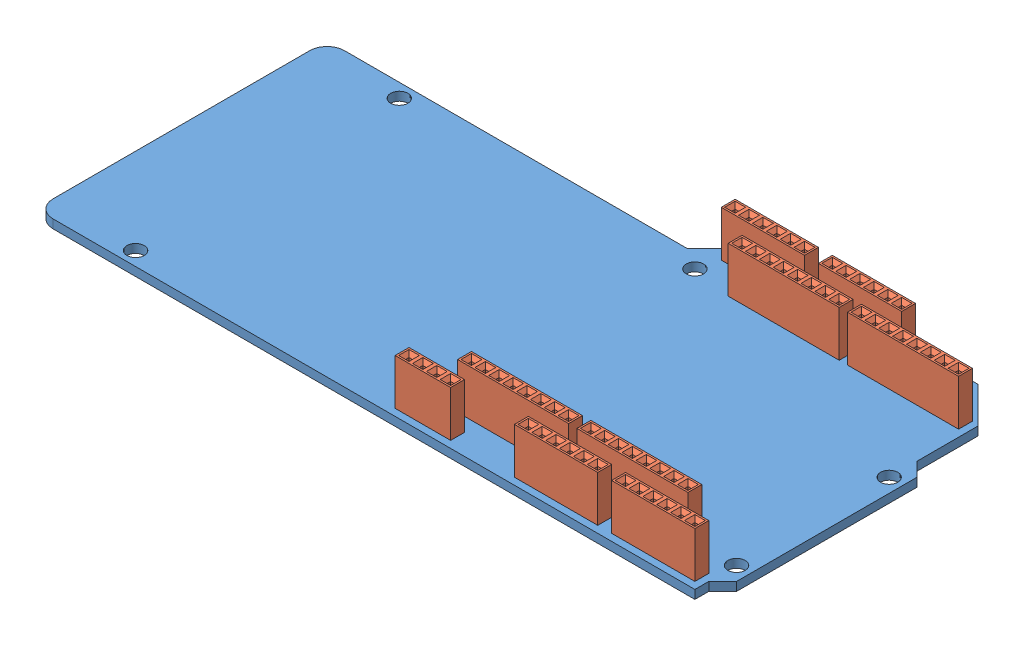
SolidWorks assembly RASCAL.SLDASM, configuration Default (file format 4400). Lengths in mm.
Overall size (123.19 9.97 58.42).
12 component instances, 2 part files, 10 mates.
Components (placement in the parent):
- PCB-1: PCB.SLDPRT [Default] at (-56.4315 9.8429 19.2589) size (123.19 1.59 58.42)
- SHIELD CONNECTORS-3: SHIELD CONNECTORS.SLDASM [Default] at (88.4256 -10.8439 18.5745) size (42.16 8.38 50.8)
  - HEADER, FEMALE-1: HEADER, FEMALE.SLDPRT [6-pin] at (-26.747 22.2743 -1.8556) size (15.24 8.38 2.54)
  - HEADER, FEMALE-2: HEADER, FEMALE.SLDPRT [6-pin] at (-44.527 22.2743 -1.8556) size (15.24 8.38 2.54)
  - HEADER, FEMALE-3: HEADER, FEMALE.SLDPRT [8-pin] at (-48.591 22.2743 -50.1156) size (20.32 8.38 2.54)
  - HEADER, FEMALE-4: HEADER, FEMALE.SLDPRT [8-pin] at (-26.747 22.2743 -50.1156) size (20.32 8.38 2.54)
- SHIELD CONNECTORS-4: SHIELD CONNECTORS.SLDASM [Default] at (-11.0425 -10.8439 -38.4768) x (-1 0 0) z (0 0 -1) size (42.16 8.38 50.8)
  - HEADER, FEMALE-1: HEADER, FEMALE.SLDPRT [6-pin] at (-26.747 22.2743 -1.8556) size (15.24 8.38 2.54)
  - HEADER, FEMALE-2: HEADER, FEMALE.SLDPRT [6-pin] at (-44.527 22.2743 -1.8556) size (15.24 8.38 2.54)
  - HEADER, FEMALE-3: HEADER, FEMALE.SLDPRT [8-pin] at (-48.591 22.2743 -50.1156) size (20.32 8.38 2.54)
  - HEADER, FEMALE-4: HEADER, FEMALE.SLDPRT [8-pin] at (-26.747 22.2743 -50.1156) size (20.32 8.38 2.54)
- HEADER, FEMALE-1: HEADER, FEMALE.SLDPRT [4-pin] at (16.9745 11.4304 16.7189) size (10.16 8.38 2.54)
Mates (geometry in assembly coordinates):
- Coincident1: coincident anti-aligned: plane of PCB-1 through (-53.2565 11.4304 16.0839) normal (0 1 0); plane of SHIELD CONNECTORS-3/HEADER, FEMALE-1 through (60.4085 11.4304 15.4489) normal (0 -1 0)
- Distance1: distance = 1.27 mm aligned: plane of SHIELD CONNECTORS-3/HEADER, FEMALE-1 through (62.9485 19.8124 17.9889) normal (1 0 0); plane of PCB-1 through (64.2185 11.4304 19.2589) normal (1 0 0)
- Distance2: distance = 1.27 mm aligned: plane of SHIELD CONNECTORS-3/HEADER, FEMALE-1 through (60.4085 19.8124 17.9889) normal (0 0 1); plane of PCB-1 through (-53.2565 11.4304 19.2589) normal (0 0 1)
- Coincident4: coincident: plane of PCB-1 through (-53.2565 11.4304 16.0839) normal (0 1 0); plane of SHIELD CONNECTORS-4/HEADER, FEMALE-1 through (16.9745 11.4304 -35.3511) normal (0 -1 0)
- Parallel1: parallel: plane of PCB-1 through (57.6145 11.4304 -39.1611) normal (0 0 -1); plane of SHIELD CONNECTORS-4/HEADER, FEMALE-1 through (16.9745 19.8124 -37.8911) normal (0 0 -1)
- Distance3: distance = 6.35 mm: plane of SHIELD CONNECTORS-4/HEADER, FEMALE-3 through (38.8185 19.8124 12.9089) normal (0 0 1); plane of PCB-1 through (-53.2565 11.4304 19.2589) normal (0 0 1)
- Distance4: distance = 7.62 mm aligned: plane of SHIELD CONNECTORS-4/HEADER, FEMALE-3 through (56.5985 19.8124 10.3689) normal (1 0 0); plane of PCB-1 through (64.2185 11.4304 19.2589) normal (1 0 0)
- Coincident8: coincident anti-aligned: plane of PCB-1 through (-53.2565 11.4304 16.0839) normal (0 1 0); plane of HEADER, FEMALE-1 through (17.972 11.4304 15.4489) normal (0 -1 0)
- Coincident9: coincident aligned: plane of SHIELD CONNECTORS-3/HEADER, FEMALE-1 through (60.4085 19.8124 17.9889) normal (0 0 1); plane of HEADER, FEMALE-1 through (15.7045 19.8124 17.9889) normal (0 0 1)
- Distance5: distance = 45.974 mm aligned: plane of HEADER, FEMALE-1 through (18.2445 19.8124 17.9889) normal (1 0 0); plane of PCB-1 through (64.2185 11.4304 19.2589) normal (1 0 0)
